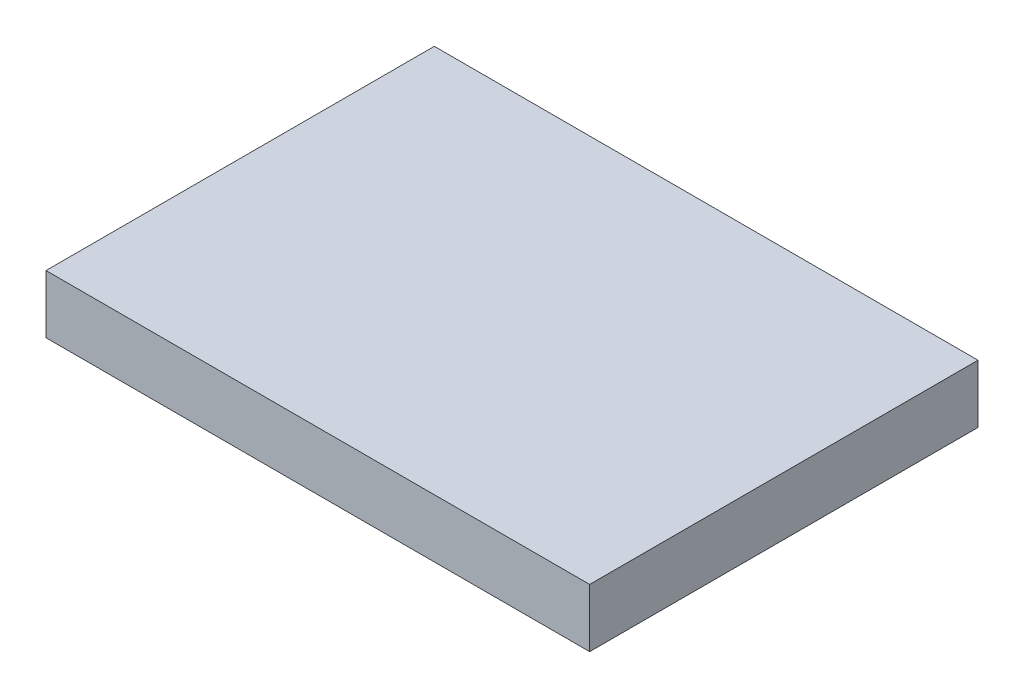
from build123d import *

# Parameters (mm, degrees)
SKETCH1_W           = 44.45
SKETCH1_H           = 31.75
BOSS_EXTRUDE1_DEPTH = 4.7625


with BuildPart() as part:
    # Sketch1 → Boss-Extrude1 (new body)
    with BuildSketch(Plane(origin=(0, 0, 0), x_dir=(1, 0, 0), z_dir=(0, 1, 0))):
        Rectangle(SKETCH1_W, SKETCH1_H)
    extrude(amount=-BOSS_EXTRUDE1_DEPTH)


solid = part.part
